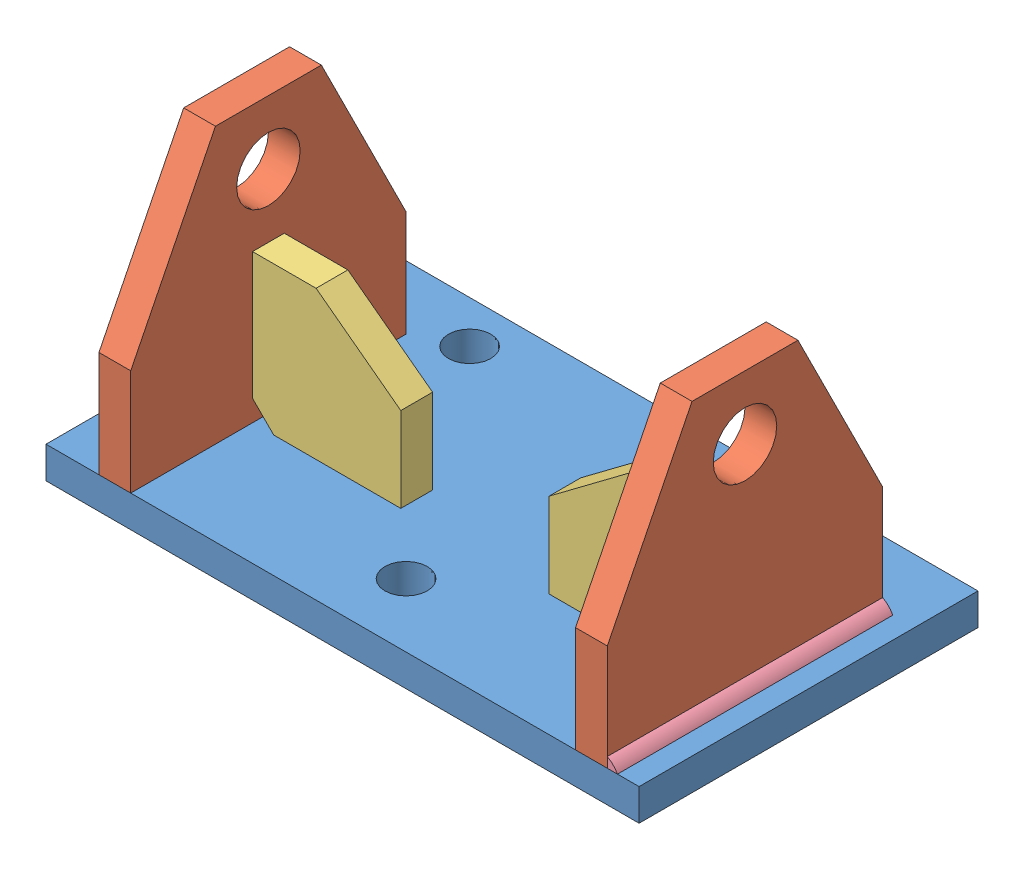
SolidWorks assembly BASIC MATES.SLDASM, configuration Default (file format 3100). Lengths in mm.
Overall size (177.8 92.08 101.6).
6 component instances, 4 part files, 12 mates.
Components (placement in the parent):
- RECTBASE-1: RECTBASE.SLDPRT [Default] at origin size (177.8 9.53 101.6)
- ENDCONNECT-1: ENDCONNECT.SLDPRT [Default] at (-63.5 9.525 9.525) x (0 0 1) z (-1 0 0) size (82.55 82.55 9.53)
- ENDCONNECT-2: ENDCONNECT.SLDPRT [Default] at (79.375 9.525 9.525) x (0 0 1) z (-1 0 0) size (82.55 82.55 9.53)
- BRACE-1: BRACE.SLDPRT [Default] at (-63.5 9.525 9.525) x (1 0 0) z (0 -1 0) size (44.45 9.53 44.45)
- BRACE-2: BRACE.SLDPRT [Default] at (69.85 9.525 9.525) x (-1 0 0) z (0 -1 0) size (44.45 9.53 44.45)
- bead2-1: bead2.sldprt [Default] at origin size (3.05 3.05 82.55)
Mates (geometry in assembly coordinates):
- Coincident1: coincident aligned: plane of ?; plane of ?
- Coincident2: coincident anti-aligned: plane of ?; plane of ?
- Coincident3: coincident anti-aligned: plane of ?; plane of ?
- Coincident4: coincident aligned: plane of ?; plane of ?
- Distance1: distance = 9.525 mm aligned: plane of ?; plane of ?
- Distance2: distance = 133.35 mm anti-aligned: plane of ?; plane of ?
- Coincident5: coincident anti-aligned: plane of ?; plane of ?
- Coincident6: coincident anti-aligned: plane of ?; plane of ?
- Coincident7: coincident anti-aligned: plane of ?; plane of ?
- Coincident10: coincident anti-aligned: plane of ?; plane of ?
- Coincident11: coincident aligned: plane of ?; plane of ?
- Coincident12: coincident aligned: plane of ?; plane of ?
